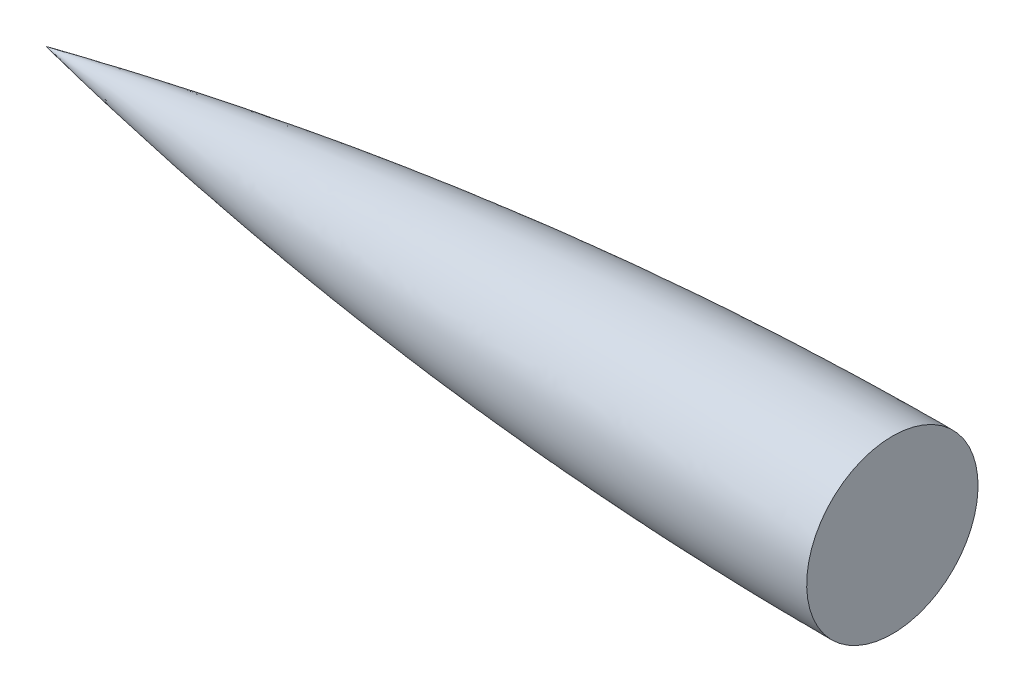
ISO-10303-21;
HEADER;
FILE_DESCRIPTION(('STEP AP214'),'2;1');
FILE_NAME('part.step','',(''),(''),'','','');
FILE_SCHEMA(('AUTOMOTIVE_DESIGN { 1 0 10303 214 1 1 1 1 }'));
ENDSEC;
DATA;
#1=APPLICATION_CONTEXT('core data for automotive mechanical design processes');
#2=APPLICATION_PROTOCOL_DEFINITION('international standard','automotive_design',2000,#1);
#3=PRODUCT_CONTEXT('',#1,'mechanical');
#4=PRODUCT('Part','Part','',(#3));
#5=PRODUCT_RELATED_PRODUCT_CATEGORY('part','',(#4));
#6=PRODUCT_DEFINITION_FORMATION('','',#4);
#7=PRODUCT_DEFINITION_CONTEXT('part definition',#1,'design');
#8=PRODUCT_DEFINITION('design','',#6,#7);
#9=PRODUCT_DEFINITION_SHAPE('','',#8);
#10=(LENGTH_UNIT() NAMED_UNIT(*) SI_UNIT(.MILLI.,.METRE.));
#11=(NAMED_UNIT(*) PLANE_ANGLE_UNIT() SI_UNIT($,.RADIAN.));
#12=(NAMED_UNIT(*) SI_UNIT($,.STERADIAN.) SOLID_ANGLE_UNIT());
#13=UNCERTAINTY_MEASURE_WITH_UNIT(LENGTH_MEASURE(1.E-05),#10,'distance_accuracy_value','');
#14=(GEOMETRIC_REPRESENTATION_CONTEXT(3) GLOBAL_UNCERTAINTY_ASSIGNED_CONTEXT((#13)) GLOBAL_UNIT_ASSIGNED_CONTEXT((#10,
#11,#12)) REPRESENTATION_CONTEXT('',''));
#15=CARTESIAN_POINT('',(0.,0.,0.));
#16=DIRECTION('',(0.,0.,1.));
#17=DIRECTION('',(1.,0.,0.));
#18=AXIS2_PLACEMENT_3D('',#15,#16,#17);
#19=CARTESIAN_POINT('',(0.,0.,0.));
#20=DIRECTION('',(1.,0.,0.));
#21=DIRECTION('',(0.,1.,0.));
#22=AXIS2_PLACEMENT_3D('',#19,#20,#21);
#23=PLANE('',#22);
#24=CARTESIAN_POINT('',(0.,0.,0.));
#25=DIRECTION('',(1.,0.,0.));
#26=DIRECTION('',(0.,1.,0.));
#27=AXIS2_PLACEMENT_3D('',#24,#25,#26);
#28=CIRCLE('',#27,6.858);
#29=CARTESIAN_POINT('',(0.,6.858,0.));
#30=VERTEX_POINT('',#29);
#31=EDGE_CURVE('E11',#30,#30,#28,.T.);
#32=ORIENTED_EDGE('',*,*,#31,.T.);
#33=EDGE_LOOP('',(#32));
#34=FACE_BOUND('',#33,.T.);
#35=ADVANCED_FACE('F31',(#34),#23,.T.);
#36=CARTESIAN_POINT('',(0.,-331.140223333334,0.));
#37=DIRECTION('',(0.,0.,-1.));
#38=DIRECTION('',(0.,1.,0.));
#39=AXIS2_PLACEMENT_3D('',#36,#37,#38);
#40=CIRCLE('',#39,337.998223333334);
#41=TRIMMED_CURVE('',#40,(PARAMETER_VALUE(-0.201787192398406)),
(PARAMETER_VALUE(0.201787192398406)),.T.,.PARAMETER.);
#42=CARTESIAN_POINT('',(0.,0.,0.));
#43=DIRECTION('',(1.,0.,0.));
#44=AXIS1_PLACEMENT('',#42,#43);
#45=SURFACE_OF_REVOLUTION('',#41,#44);
#46=CARTESIAN_POINT('',(-67.7418,0.,0.));
#47=VERTEX_POINT('',#46);
#48=VERTEX_LOOP('',#47);
#49=FACE_BOUND('',#48,.T.);
#50=ORIENTED_EDGE('',*,*,#31,.F.);
#51=EDGE_LOOP('',(#50));
#52=FACE_BOUND('',#51,.T.);
#53=ADVANCED_FACE('F38',(#49,#52),#45,.T.);
#54=CLOSED_SHELL('',(#35,#53));
#55=MANIFOLD_SOLID_BREP('B2',#54);
#56=ADVANCED_BREP_SHAPE_REPRESENTATION('',(#18,#55),#14);
#57=SHAPE_DEFINITION_REPRESENTATION(#9,#56);
ENDSEC;
END-ISO-10303-21;
